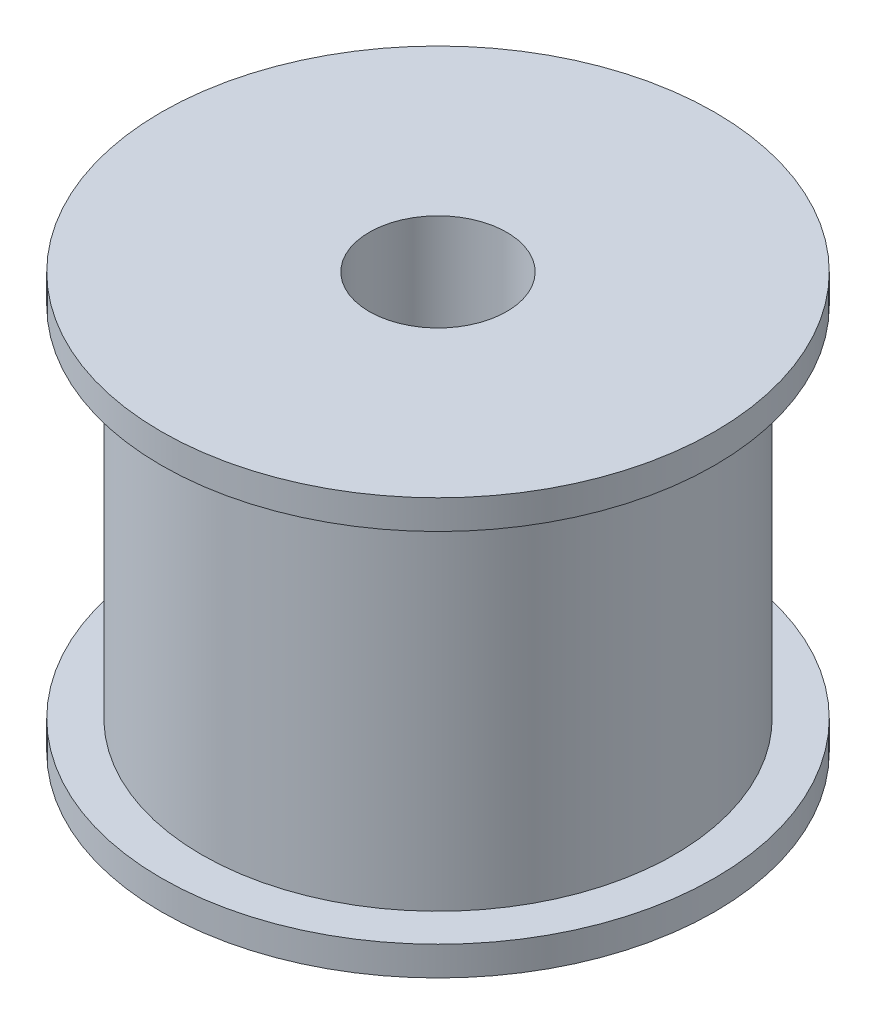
from build123d import *

# Parameters (mm, degrees)
CROQUIS2_R            = 4
CORTAR_EXTRUIR1_DEPTH = 34.227398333


with BuildPart() as part:
    # Croquis1 → Revoluci_n1 (revolve)
    with BuildSketch(Plane.XY, mode=Mode.PRIVATE) as revoluci_n1_sk:
        Polygon((13.75, 10.4), (16.1, 10.4), (16.1, 12.1), (0, 12.1), (0, 10.4), (0, -10.4), (0, -12.1), (16.1, -12.1), (16.1, -10.4), (13.75, -10.4), align=None)
    revolve(revoluci_n1_sk.sketch.rotate(Axis((0, -21.040891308, 0), (0, 1, 0)), 90), axis=Axis((0, -21.040891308, 0), (0, 1, 0)))

    # Croquis2 → Cortar-Extruir1 (cut, through all)
    with BuildSketch(Plane(origin=(0, 12.1, 0), x_dir=(1, 0, 0), z_dir=(0, 1, 0))):
        with Locations(Location((0, 0, 0), (0, 0, 270))):
            Circle(CROQUIS2_R)
    extrude(amount=-CORTAR_EXTRUIR1_DEPTH, mode=Mode.SUBTRACT)


solid = part.part
